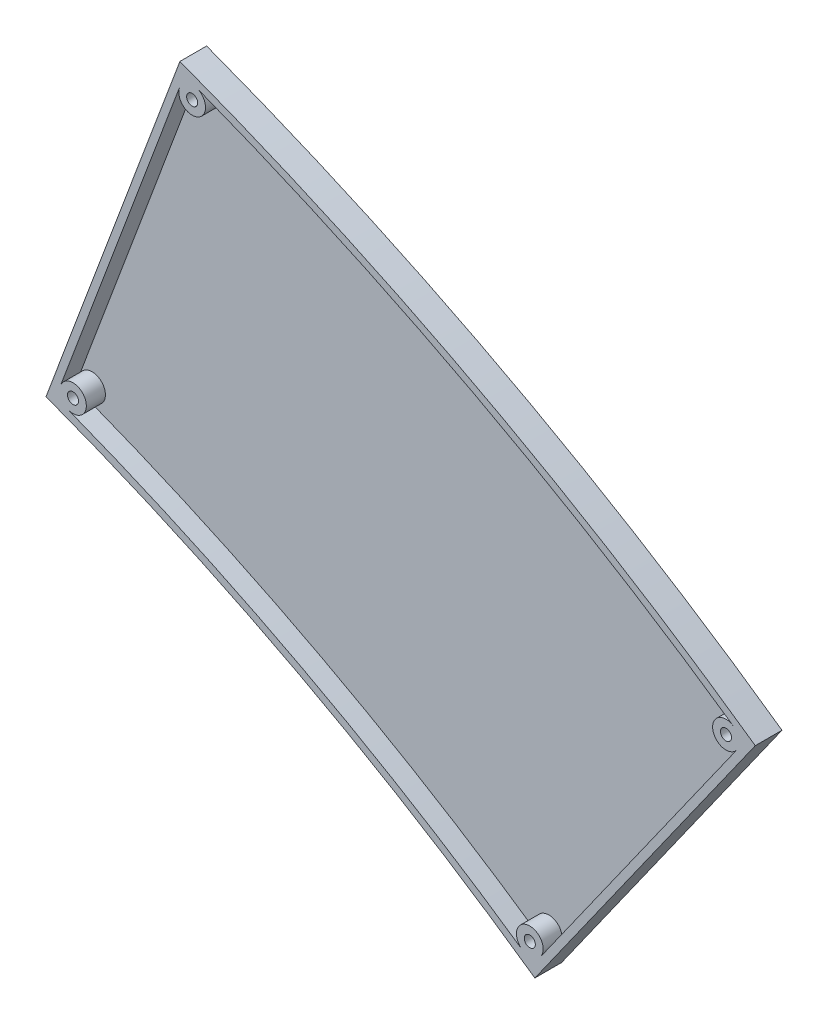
from build123d import *

# Parameters (mm, degrees)
BOSS_EXTRUDE1_DEPTH  = 2
EXTRUDE_THIN1_START  = 5
EXTRUDE_THIN1_DEPTH  = 5
BOSS_EXTRUDE15_START = 5
BOSS_EXTRUDE15_DEPTH = 5
CUT_EXTRUDE7_START   = -5.5
SKETCH14_R           = 3.5
CUT_EXTRUDE7_DEPTH   = 1.5
SKETCH15_R           = 1.45
CUT_EXTRUDE8_DEPTH   = 732.701957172


with BuildPart() as part:
    # Sketch2 → Boss-Extrude1 (new body)
    with BuildSketch(Plane.XY):
        with BuildLine():
            Line((198.297374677, 529.05874078), (233.394255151, 622.697455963))
            ThreePointArc((233.394255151, 622.697455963), (311.368440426, 587.600795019), (384.194459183, 542.788741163))
            Line((384.194459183, 542.788741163), (326.420856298, 461.166374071))
            ThreePointArc((326.420856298, 461.166374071), (264.546118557, 499.239773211), (198.297374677, 529.05874078))
        make_face()
    extrude(amount=-BOSS_EXTRUDE1_DEPTH)

    # Sketch4 → Extrude-Thin1 (add)
    with BuildSketch(Plane.XY.offset(EXTRUDE_THIN1_START)):
        with BuildLine():
            Line((233.394255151, 622.697455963), (198.297374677, 529.05874078))
            ThreePointArc((198.297374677, 529.05874078), (264.546118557, 499.239773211), (326.420856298, 461.166374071))
            Line((326.420856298, 461.166374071), (384.194459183, 542.788741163))
            ThreePointArc((384.194459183, 542.788741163), (311.368440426, 587.600795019), (233.394255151, 622.697455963))
        make_face()
        with BuildLine():
            Line((234.564033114, 620.119919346), (200.870848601, 530.226274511))
            ThreePointArc((200.870848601, 530.226274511), (265.482564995, 501.006993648), (325.941843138, 463.951414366))
            Line((325.941843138, 463.951414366), (381.404796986, 542.30930366))
            ThreePointArc((381.404796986, 542.30930366), (310.431993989, 585.833574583), (234.564033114, 620.119919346))
        make_face(mode=Mode.SUBTRACT)
    extrude(amount=-EXTRUDE_THIN1_DEPTH)

    # Sketch8 → Boss-Extrude15 (add)
    with BuildSketch(Plane.XY.offset(BOSS_EXTRUDE15_START)):
        with BuildLine():
            Line((381.404796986, 542.30930366), (379.37121363, 539.436263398))
            ThreePointArc((379.37121363, 539.436263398), (373.067047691, 540.85373233), (378.512611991, 544.331886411))
            ThreePointArc((378.512611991, 544.331886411), (379.960050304, 543.322519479), (381.404796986, 542.30930366))
        make_face()
        with BuildLine():
            Line((234.564033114, 620.119919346), (233.328651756, 616.823913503))
            ThreePointArc((233.328651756, 616.823913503), (238.041545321, 612.403465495), (237.861686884, 618.862519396))
            ThreePointArc((237.861686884, 618.862519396), (236.213696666, 619.493413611), (234.564033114, 620.119919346))
        make_face()
        with BuildLine():
            Line((202.091172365, 533.48210659), (200.870848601, 530.226274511))
            ThreePointArc((200.870848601, 530.226274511), (202.490669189, 529.609789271), (204.10859778, 528.988355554))
            ThreePointArc((204.10859778, 528.988355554), (208.561517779, 533.687177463), (202.091172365, 533.48210659))
        make_face()
        with BuildLine():
            Line((327.950639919, 466.789436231), (325.941843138, 463.951414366))
            ThreePointArc((325.941843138, 463.951414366), (324.52214579, 464.945563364), (323.099416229, 465.935368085))
            ThreePointArc((323.099416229, 465.935368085), (324.48700739, 472.258501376), (327.950639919, 466.789436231))
        make_face()
    extrude(amount=-BOSS_EXTRUDE15_DEPTH)

    # Sketch14 → Cut-Extrude7 (cut)
    with BuildSketch(Plane.XY.offset(5).offset(CUT_EXTRUDE7_START)):
        with Locations((236.606006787, 615.595522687)):
            Circle(SKETCH14_R)
        with Locations((205.368527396, 532.253715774)):
            Circle(SKETCH14_R)
        with Locations((325.09385707, 468.811512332)):
            Circle(SKETCH14_R)
        with Locations((376.514430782, 541.458339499)):
            Circle(SKETCH14_R)
    extrude(amount=-CUT_EXTRUDE7_DEPTH, mode=Mode.SUBTRACT)

    # Sketch15 → Cut-Extrude8 (cut, through all)
    with BuildSketch(Plane(origin=(0, 0, -0.5), x_dir=(-1, 0, 0), z_dir=(0, 0, -1))):
        with Locations((-376.514430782, 541.458339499)):
            Circle(SKETCH15_R)
        with Locations((-325.09385707, 468.811512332)):
            Circle(SKETCH15_R)
        with Locations((-205.368527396, 532.253715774)):
            Circle(SKETCH15_R)
        with Locations((-236.606006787, 615.595522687)):
            Circle(SKETCH15_R)
    extrude(amount=-CUT_EXTRUDE8_DEPTH, mode=Mode.SUBTRACT)


solid = part.part
